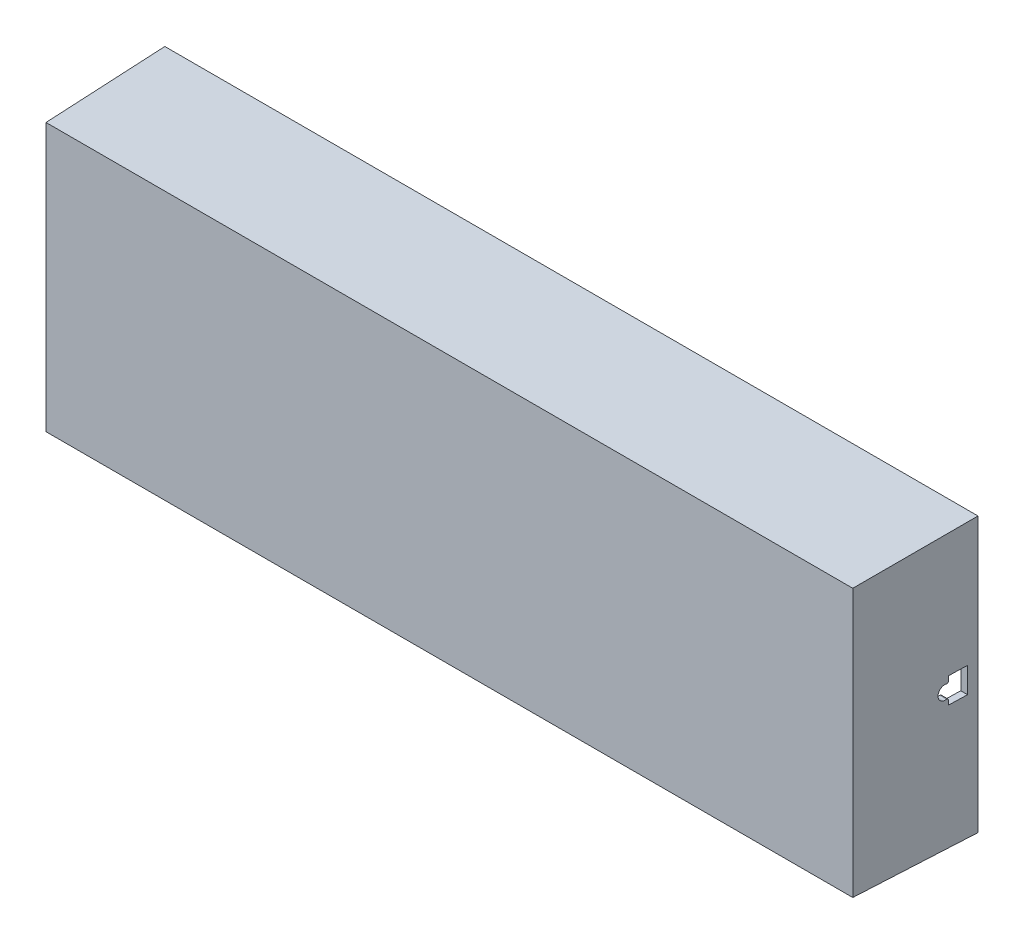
from build123d import *

# Parameters (mm, degrees)
ESQUISSE1_W             = 239.9
ESQUISSE1_H             = 80.9
EXTRUSION1_DEPTH        = 36
EXTRUSION1_TAPER        = 1.5
ESQUISSE2_W             = 235.9
ESQUISSE2_H             = 76.9
ENL_V_MAT_EXTRU_1_DEPTH = 34
ENL_V_MAT_EXTRU_1_DRAFT = -1.5
ESQUISSE3_W             = 28
ESQUISSE3_H             = 1
EXTRUSION2_DEPTH        = 1
ENL_V_MAT_EXTRU_3_DEPTH = 200


with BuildPart() as part:
    # Esquisse1 → Extrusion1 (new body)
    with BuildSketch(Plane.XY):
        Rectangle(ESQUISSE1_W, ESQUISSE1_H)
    extrude(amount=EXTRUSION1_DEPTH, taper=EXTRUSION1_TAPER)


with BuildPart() as enl_v_mat_extru_1_tool:
    # Esquisse2 → Enl_v. mat.-Extru.1 (with draft: the straight prism first)
    with BuildSketch(Plane(origin=(0, 0, 0), x_dir=(-1, 0, 0), z_dir=(0, 0, -1))):
        Rectangle(ESQUISSE2_W, ESQUISSE2_H)
    extrude(amount=-ENL_V_MAT_EXTRU_1_DEPTH)
    # Enl_v. mat.-Extru.1: the draft: its side faces are tilted about the plane it starts from
    enl_v_mat_extru_1_sides = [enl_v_mat_extru_1_tool.faces().sort_by_distance(p)[0] for p in [
        (117.95, 0, 17),
        (0, -38.45, 17),
        (-117.95, 0, 17),
        (0, 38.45, 17),
    ]]
    draft(enl_v_mat_extru_1_sides, Plane(origin=(0, 0, 0), x_dir=(-1, 0, 0), z_dir=(0, 0, -1)), ENL_V_MAT_EXTRU_1_DRAFT)


with BuildPart() as part_1:
    add(part.part)

    # Enl_v. mat.-Extru.1: cut by enl_v_mat_extru_1_tool
    add(enl_v_mat_extru_1_tool.part, mode=Mode.SUBTRACT)

    # Esquisse3 → Extrusion2 (add)
    with BuildSketch(Plane.XY):
        with Locations((-20.45, -38.95)):
            Rectangle(ESQUISSE3_W, ESQUISSE3_H)
        with Locations((20.45, -38.95)):
            Rectangle(ESQUISSE3_W, ESQUISSE3_H)
        with Locations((20.45, 38.95)):
            Rectangle(ESQUISSE3_W, ESQUISSE3_H)
        with Locations((-20.45, 38.95)):
            Rectangle(ESQUISSE3_W, ESQUISSE3_H)
    extrude(amount=-EXTRUSION2_DEPTH)

    # Esquisse4 → Enl_v. mat.-Extru.3 (cut, symmetric)
    with BuildSketch(Plane(origin=(0, 0, 0), x_dir=(0, 0, -1), z_dir=(1, 0, 0))):
        with BuildLine():
            Line((-3, 3.75), (-8.5, 3.75))
            Line((-8.5, 3.75), (-8.5, 2.449489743))
            ThreePointArc((-8.5, 2.449489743), (-8.683772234, 2.062191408), (-9.1, 1.959591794))
            ThreePointArc((-9.1, 1.959591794), (-11.5, 0), (-9.1, -1.959591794))
            ThreePointArc((-9.1, -1.959591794), (-8.683772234, -2.062191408), (-8.5, -2.449489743))
            Line((-8.5, -2.449489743), (-8.5, -3.75))
            Line((-8.5, -3.75), (-3, -3.75))
            Line((-3, -3.75), (-3, 3.75))
        make_face()
    extrude(amount=ENL_V_MAT_EXTRU_3_DEPTH, both=True, mode=Mode.SUBTRACT)


solid = part_1.part
